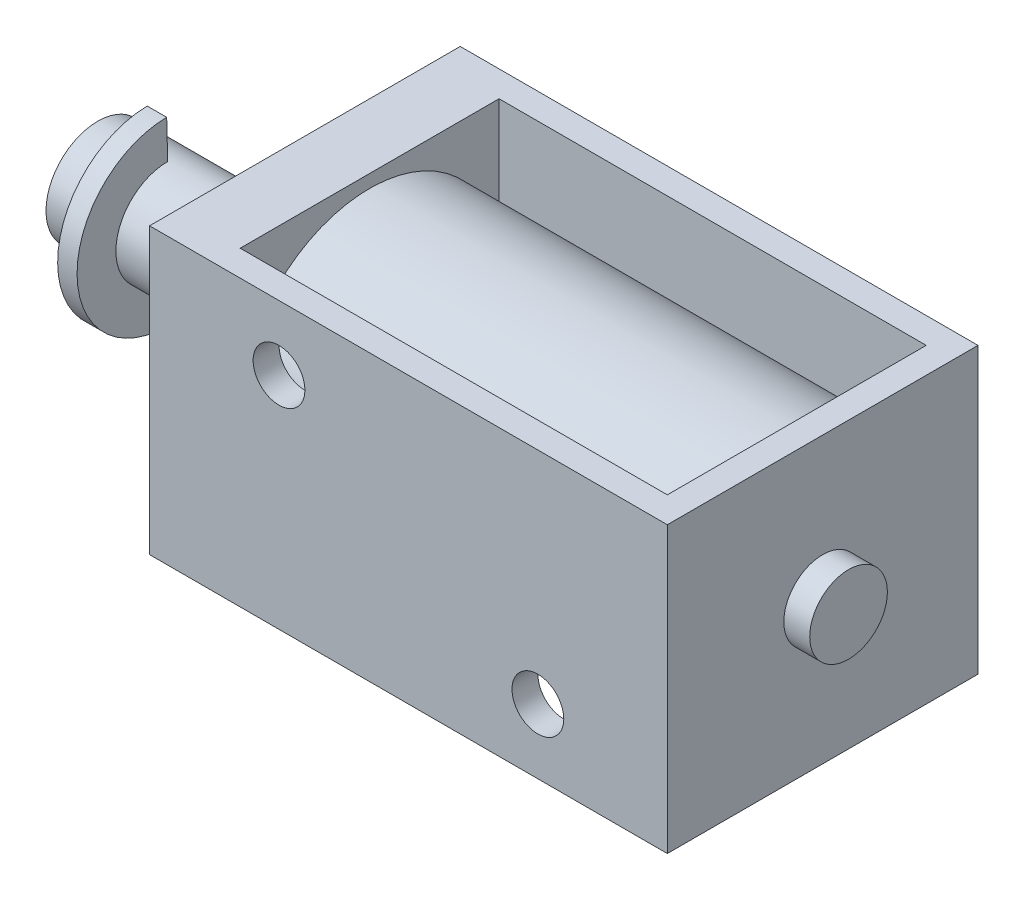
ISO-10303-21;
HEADER;
FILE_DESCRIPTION(('STEP AP214'),'2;1');
FILE_NAME('part.step','',(''),(''),'','','');
FILE_SCHEMA(('AUTOMOTIVE_DESIGN { 1 0 10303 214 1 1 1 1 }'));
ENDSEC;
DATA;
#1=APPLICATION_CONTEXT('core data for automotive mechanical design processes');
#2=APPLICATION_PROTOCOL_DEFINITION('international standard','automotive_design',2000,#1);
#3=PRODUCT_CONTEXT('',#1,'mechanical');
#4=PRODUCT('Part','Part','',(#3));
#5=PRODUCT_RELATED_PRODUCT_CATEGORY('part','',(#4));
#6=PRODUCT_DEFINITION_FORMATION('','',#4);
#7=PRODUCT_DEFINITION_CONTEXT('part definition',#1,'design');
#8=PRODUCT_DEFINITION('design','',#6,#7);
#9=PRODUCT_DEFINITION_SHAPE('','',#8);
#10=(LENGTH_UNIT() NAMED_UNIT(*) SI_UNIT(.MILLI.,.METRE.));
#11=(NAMED_UNIT(*) PLANE_ANGLE_UNIT() SI_UNIT($,.RADIAN.));
#12=(NAMED_UNIT(*) SI_UNIT($,.STERADIAN.) SOLID_ANGLE_UNIT());
#13=UNCERTAINTY_MEASURE_WITH_UNIT(LENGTH_MEASURE(1.E-05),#10,'distance_accuracy_value','');
#14=(GEOMETRIC_REPRESENTATION_CONTEXT(3) GLOBAL_UNCERTAINTY_ASSIGNED_CONTEXT((#13)) GLOBAL_UNIT_ASSIGNED_CONTEXT((#10,
#11,#12)) REPRESENTATION_CONTEXT('',''));
#15=CARTESIAN_POINT('',(0.,0.,0.));
#16=DIRECTION('',(0.,0.,1.));
#17=DIRECTION('',(1.,0.,0.));
#18=AXIS2_PLACEMENT_3D('',#15,#16,#17);
#19=CARTESIAN_POINT('',(19.,0.,-11.));
#20=DIRECTION('',(1.,0.,0.));
#21=DIRECTION('',(0.,0.,-1.));
#22=AXIS2_PLACEMENT_3D('',#19,#20,#21);
#23=PLANE('',#22);
#24=CARTESIAN_POINT('',(19.0000000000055,5.5,-6.));
#25=DIRECTION('',(1.,0.,0.));
#26=DIRECTION('',(0.,0.,-1.));
#27=AXIS2_PLACEMENT_3D('',#24,#25,#26);
#28=CIRCLE('',#27,5.);
#29=CARTESIAN_POINT('',(19.0000000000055,5.5,-11.));
#30=VERTEX_POINT('',#29);
#31=EDGE_CURVE('E78',#30,#30,#28,.T.);
#32=ORIENTED_EDGE('',*,*,#31,.T.);
#33=EDGE_LOOP('',(#32));
#34=FACE_BOUND('',#33,.T.);
#35=ADVANCED_FACE('F43',(#34),#23,.T.);
#36=CARTESIAN_POINT('',(2.5,5.5,-6.));
#37=DIRECTION('',(1.,0.,0.));
#38=DIRECTION('',(0.,0.,-1.));
#39=AXIS2_PLACEMENT_3D('',#36,#37,#38);
#40=PLANE('',#39);
#41=CARTESIAN_POINT('',(2.5,5.5,-6.));
#42=DIRECTION('',(1.,0.,0.));
#43=DIRECTION('',(0.,0.,-1.));
#44=AXIS2_PLACEMENT_3D('',#41,#42,#43);
#45=CIRCLE('',#44,5.);
#46=CARTESIAN_POINT('',(2.5,5.5,-11.));
#47=VERTEX_POINT('',#46);
#48=EDGE_CURVE('E108',#47,#47,#45,.T.);
#49=ORIENTED_EDGE('',*,*,#48,.F.);
#50=EDGE_LOOP('',(#49));
#51=FACE_BOUND('',#50,.T.);
#52=ADVANCED_FACE('F96',(#51),#40,.F.);
#53=CARTESIAN_POINT('',(500000.,5.5,-6.00000000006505));
#54=DIRECTION('',(-1.,0.,0.));
#55=DIRECTION('',(0.,0.,1.));
#56=AXIS2_PLACEMENT_3D('',#53,#54,#55);
#57=CYLINDRICAL_SURFACE('',#56,5.);
#58=DIRECTION('',(-1.,0.,0.));
#59=VECTOR('',#58,1.);
#60=CARTESIAN_POINT('',(500000.,2.50000000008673,-2.));
#61=LINE('',#60,#59);
#62=CARTESIAN_POINT('',(14.00000000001,2.50000000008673,-1.99999999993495));
#63=VERTEX_POINT('',#62);
#64=CARTESIAN_POINT('',(16.,2.50000000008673,-2.));
#65=VERTEX_POINT('',#64);
#66=EDGE_CURVE('E54',#63,#65,#61,.F.);
#67=ORIENTED_EDGE('',*,*,#66,.F.);
#68=CARTESIAN_POINT('',(14.,2.50000000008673,-2.));
#69=CARTESIAN_POINT('',(13.9999996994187,2.53399458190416,-1.97449612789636));
#70=CARTESIAN_POINT('',(14.0017343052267,2.56833744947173,-1.94942402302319));
#71=CARTESIAN_POINT('',(14.0088815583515,2.63745557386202,-1.90028975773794));
#72=CARTESIAN_POINT('',(14.0143011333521,2.67223152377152,-1.87622959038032));
#73=CARTESIAN_POINT('',(14.0290598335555,2.74197097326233,-1.82926220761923));
#74=CARTESIAN_POINT('',(14.0384157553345,2.77693463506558,-1.80636040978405));
#75=CARTESIAN_POINT('',(14.0612095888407,2.84642414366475,-1.76204844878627));
#76=CARTESIAN_POINT('',(14.0746437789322,2.88095035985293,-1.74063694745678));
#77=CARTESIAN_POINT('',(14.1124068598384,2.96372057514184,-1.69064871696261));
#78=CARTESIAN_POINT('',(14.1389376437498,3.01150826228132,-1.66292953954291));
#79=CARTESIAN_POINT('',(14.2006215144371,3.10336223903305,-1.6115040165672));
#80=CARTESIAN_POINT('',(14.2357519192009,3.14743791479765,-1.58778738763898));
#81=CARTESIAN_POINT('',(14.3145006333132,3.23032564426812,-1.54457874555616));
#82=CARTESIAN_POINT('',(14.3581685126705,3.2691045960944,-1.52511288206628));
#83=CARTESIAN_POINT('',(14.4528625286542,3.33910957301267,-1.49088927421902));
#84=CARTESIAN_POINT('',(14.5038907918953,3.37033340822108,-1.47613289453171));
#85=CARTESIAN_POINT('',(14.6065050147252,3.42093331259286,-1.45267252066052));
#86=CARTESIAN_POINT('',(14.6575739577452,3.44115513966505,-1.44352561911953));
#87=CARTESIAN_POINT('',(14.762842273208,3.47302422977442,-1.42925849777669));
#88=CARTESIAN_POINT('',(14.817039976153,3.48467602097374,-1.42413615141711));
#89=CARTESIAN_POINT('',(14.9237530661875,3.49845813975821,-1.41809178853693));
#90=CARTESIAN_POINT('',(14.9761925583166,3.50108539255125,-1.41695050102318));
#91=CARTESIAN_POINT('',(15.0807891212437,3.4981027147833,-1.41825249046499));
#92=CARTESIAN_POINT('',(15.1329462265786,3.49249381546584,-1.42069531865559));
#93=CARTESIAN_POINT('',(15.2347293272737,3.47341951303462,-1.4291055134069));
#94=CARTESIAN_POINT('',(15.2843807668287,3.46006695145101,-1.43502227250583));
#95=CARTESIAN_POINT('',(15.3805809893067,3.42615304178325,-1.4503294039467));
#96=CARTESIAN_POINT('',(15.4271297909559,3.40559173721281,-1.45971975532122));
#97=CARTESIAN_POINT('',(15.5166789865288,3.35770791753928,-1.48211430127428));
#98=CARTESIAN_POINT('',(15.5596088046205,3.3302802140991,-1.49517514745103));
#99=CARTESIAN_POINT('',(15.6400854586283,3.26994904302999,-1.52473479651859));
#100=CARTESIAN_POINT('',(15.6776314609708,3.23704472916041,-1.5412341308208));
#101=CARTESIAN_POINT('',(15.7484979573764,3.16515408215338,-1.57843771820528));
#102=CARTESIAN_POINT('',(15.7814940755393,3.12593944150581,-1.59931696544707));
#103=CARTESIAN_POINT('',(15.8404311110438,3.04425656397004,-1.64437140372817));
#104=CARTESIAN_POINT('',(15.866369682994,3.00178725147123,-1.66854768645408));
#105=CARTESIAN_POINT('',(15.9134301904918,2.91053780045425,-1.7224111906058));
#106=CARTESIAN_POINT('',(15.9337982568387,2.8615541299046,-1.75240856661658));
#107=CARTESIAN_POINT('',(15.9662602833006,2.76276754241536,-1.8153863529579));
#108=CARTESIAN_POINT('',(15.9783504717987,2.71296426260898,-1.8483681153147));
#109=CARTESIAN_POINT('',(15.9911173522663,2.63588448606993,-1.90146823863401));
#110=CARTESIAN_POINT('',(15.9944791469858,2.6084544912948,-1.92077307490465));
#111=CARTESIAN_POINT('',(15.998916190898,2.55394946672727,-1.95996141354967));
#112=CARTESIAN_POINT('',(15.999998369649,2.52687361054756,-1.97984297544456));
#113=CARTESIAN_POINT('',(16.,2.5,-2.));
#114=B_SPLINE_CURVE_WITH_KNOTS('',3,(#68,#69,#70,#71,#72,#73,#74,#75,#76,#77,#78,#79,#80,#81,
#82,#83,#84,#85,#86,#87,#88,#89,#90,#91,#92,#93,#94,#95,#96,#97,#98,#99,#100,#101,#102,#103,
#104,#105,#106,#107,#108,#109,#110,#111,#112,#113),.UNSPECIFIED.,.F.,.F.,(4,2,2,2,2,2,2,2,2,2,2,
2,2,2,2,2,2,2,2,2,2,2,4),(0.,0.127483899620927,0.255208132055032,0.383482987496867,
0.511641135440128,0.694674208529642,0.877229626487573,1.06087827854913,1.24458009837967,
1.4107675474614,1.57686712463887,1.73365980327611,1.89043285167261,2.04497682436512,
2.19951986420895,2.35659321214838,2.51369085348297,2.67901784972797,2.84439972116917,
3.02653100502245,3.20874521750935,3.30980206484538,3.41055127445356),.UNSPECIFIED.);
#115=EDGE_CURVE('E12',#63,#65,#114,.T.);
#116=ORIENTED_EDGE('',*,*,#115,.T.);
#117=EDGE_LOOP('',(#67,#116));
#118=FACE_BOUND('',#117,.T.);
#119=DIRECTION('',(-1.,0.,0.));
#120=VECTOR('',#119,1.);
#121=CARTESIAN_POINT('',(500000.,8.49999999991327,-2.));
#122=LINE('',#121,#120);
#123=CARTESIAN_POINT('',(6.00000000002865,8.49999999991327,-1.99999999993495));
#124=VERTEX_POINT('',#123);
#125=CARTESIAN_POINT('',(4.,8.49999999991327,-2.));
#126=VERTEX_POINT('',#125);
#127=EDGE_CURVE('E73',#124,#126,#122,.T.);
#128=ORIENTED_EDGE('',*,*,#127,.F.);
#129=CARTESIAN_POINT('',(6.,8.5,-2.));
#130=CARTESIAN_POINT('',(6.00000030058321,8.46600541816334,-1.97449612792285));
#131=CARTESIAN_POINT('',(5.99826569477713,8.43166255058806,-1.94942402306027));
#132=CARTESIAN_POINT('',(5.99111844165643,8.36254442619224,-1.90028975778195));
#133=CARTESIAN_POINT('',(5.98569886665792,8.32776847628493,-1.87622959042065));
#134=CARTESIAN_POINT('',(5.97094016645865,8.2580290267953,-1.82926220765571));
#135=CARTESIAN_POINT('',(5.96158424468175,8.22306536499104,-1.80636040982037));
#136=CARTESIAN_POINT('',(5.93879041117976,8.15357585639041,-1.76204844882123));
#137=CARTESIAN_POINT('',(5.92535622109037,8.11904964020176,-1.74063694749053));
#138=CARTESIAN_POINT('',(5.88759314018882,8.03627942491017,-1.690648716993));
#139=CARTESIAN_POINT('',(5.8610623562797,7.9884917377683,-1.66292953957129));
#140=CARTESIAN_POINT('',(5.79937848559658,7.89663776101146,-1.61150401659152));
#141=CARTESIAN_POINT('',(5.76424808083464,7.85256208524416,-1.58778738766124));
#142=CARTESIAN_POINT('',(5.68549936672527,7.76967435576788,-1.54457874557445));
#143=CARTESIAN_POINT('',(5.641831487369,7.73089540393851,-1.52511288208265));
#144=CARTESIAN_POINT('',(5.54713747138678,7.66089042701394,-1.49088927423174));
#145=CARTESIAN_POINT('',(5.4961092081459,7.62966659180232,-1.4761328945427));
#146=CARTESIAN_POINT('',(5.39349498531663,7.57906668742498,-1.45267252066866));
#147=CARTESIAN_POINT('',(5.34242604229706,7.55884486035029,-1.44352561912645));
#148=CARTESIAN_POINT('',(5.23715772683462,7.52697577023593,-1.42925849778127));
#149=CARTESIAN_POINT('',(5.18296002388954,7.51532397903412,-1.42413615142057));
#150=CARTESIAN_POINT('',(5.07624693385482,7.50154186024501,-1.41809178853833));
#151=CARTESIAN_POINT('',(5.02380744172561,7.49891460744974,-1.41695050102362));
#152=CARTESIAN_POINT('',(4.91921087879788,7.50189728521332,-1.41825249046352));
#153=CARTESIAN_POINT('',(4.86705377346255,7.50750618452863,-1.42069531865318));
#154=CARTESIAN_POINT('',(4.76527067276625,7.52658048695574,-1.42910551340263));
#155=CARTESIAN_POINT('',(4.71561923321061,7.53993304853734,-1.43502227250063));
#156=CARTESIAN_POINT('',(4.619419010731,7.57384695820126,-1.45032940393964));
#157=CARTESIAN_POINT('',(4.57287020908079,7.59440826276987,-1.45971975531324));
#158=CARTESIAN_POINT('',(4.48332101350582,7.64229208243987,-1.48211430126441));
#159=CARTESIAN_POINT('',(4.44039119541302,7.66971978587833,-1.49517514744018));
#160=CARTESIAN_POINT('',(4.35991454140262,7.73005095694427,-1.52473479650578));
#161=CARTESIAN_POINT('',(4.32236853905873,7.7629552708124,-1.54123413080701));
#162=CARTESIAN_POINT('',(4.25150204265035,7.83484591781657,-1.57843771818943));
#163=CARTESIAN_POINT('',(4.21850592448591,7.87406055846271,-1.5993169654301));
#164=CARTESIAN_POINT('',(4.1595688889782,7.95574343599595,-1.64437140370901));
#165=CARTESIAN_POINT('',(4.1336303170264,7.99821274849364,-1.66854768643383));
#166=CARTESIAN_POINT('',(4.0865698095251,8.08946219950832,-1.72241119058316));
#167=CARTESIAN_POINT('',(4.06620174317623,8.13844587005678,-1.75240856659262));
#168=CARTESIAN_POINT('',(4.03373971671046,8.23723245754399,-1.81538635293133));
#169=CARTESIAN_POINT('',(4.02164952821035,8.28703573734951,-1.84836811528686));
#170=CARTESIAN_POINT('',(4.00888264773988,8.36411551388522,-1.9014682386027));
#171=CARTESIAN_POINT('',(4.00552085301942,8.39154550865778,-1.92077307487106));
#172=CARTESIAN_POINT('',(4.00108380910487,8.44605053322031,-1.95996141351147));
#173=CARTESIAN_POINT('',(4.00000163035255,8.47312638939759,-1.97984297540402));
#174=CARTESIAN_POINT('',(3.99999999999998,8.49999999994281,-1.99999999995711));
#175=B_SPLINE_CURVE_WITH_KNOTS('',3,(#129,#130,#131,#132,#133,#134,#135,#136,#137,#138,#139,
#140,#141,#142,#143,#144,#145,#146,#147,#148,#149,#150,#151,#152,#153,#154,#155,#156,#157,#158,
#159,#160,#161,#162,#163,#164,#165,#166,#167,#168,#169,#170,#171,#172,#173,#174),.UNSPECIFIED.,
.F.,.F.,(4,2,2,2,2,2,2,2,2,2,2,2,2,2,2,2,2,2,2,2,2,2,4),(0.,0.12748389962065,0.255208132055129,
0.383482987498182,0.511641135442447,0.694674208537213,0.877229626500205,1.06087827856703,
1.24458009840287,1.4107675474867,1.57686712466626,1.73365980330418,1.89043285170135,
2.04497682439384,2.19951986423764,2.35659321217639,2.51369085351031,2.67901784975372,
2.84439972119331,3.02653100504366,3.2087452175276,3.30980206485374,3.41055127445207),.UNSPECIFIED.);
#176=EDGE_CURVE('E77',#124,#126,#175,.T.);
#177=ORIENTED_EDGE('',*,*,#176,.T.);
#178=EDGE_LOOP('',(#128,#177));
#179=FACE_BOUND('',#178,.T.);
#180=ORIENTED_EDGE('',*,*,#48,.T.);
#181=EDGE_LOOP('',(#180));
#182=FACE_BOUND('',#181,.T.);
#183=ORIENTED_EDGE('',*,*,#31,.F.);
#184=EDGE_LOOP('',(#183));
#185=FACE_BOUND('',#184,.T.);
#186=ADVANCED_FACE('F83',(#118,#179,#182,#185),#57,.T.);
#187=CARTESIAN_POINT('',(5.,8.5,-2.));
#188=DIRECTION('',(0.,0.,1.));
#189=DIRECTION('',(1.,0.,0.));
#190=AXIS2_PLACEMENT_3D('',#187,#188,#189);
#191=CYLINDRICAL_SURFACE('',#190,1.);
#192=CARTESIAN_POINT('',(5.,8.5,-2.));
#193=DIRECTION('',(0.,0.,1.));
#194=DIRECTION('',(1.,0.,0.));
#195=AXIS2_PLACEMENT_3D('',#192,#193,#194);
#196=CIRCLE('',#195,1.);
#197=EDGE_CURVE('E67',#126,#124,#196,.T.);
#198=ORIENTED_EDGE('',*,*,#197,.F.);
#199=ORIENTED_EDGE('',*,*,#176,.F.);
#200=EDGE_LOOP('',(#198,#199));
#201=FACE_BOUND('',#200,.T.);
#202=ADVANCED_FACE('F81',(#201),#191,.F.);
#203=CARTESIAN_POINT('',(5.,8.5,-2.));
#204=DIRECTION('',(0.,0.,1.));
#205=DIRECTION('',(1.,0.,0.));
#206=AXIS2_PLACEMENT_3D('',#203,#204,#205);
#207=PLANE('',#206);
#208=ORIENTED_EDGE('',*,*,#127,.T.);
#209=ORIENTED_EDGE('',*,*,#197,.T.);
#210=EDGE_LOOP('',(#208,#209));
#211=FACE_BOUND('',#210,.T.);
#212=ADVANCED_FACE('F74',(#211),#207,.T.);
#213=CARTESIAN_POINT('',(15.,2.5,-2.));
#214=DIRECTION('',(0.,0.,1.));
#215=DIRECTION('',(1.,0.,0.));
#216=AXIS2_PLACEMENT_3D('',#213,#214,#215);
#217=CYLINDRICAL_SURFACE('',#216,1.);
#218=CARTESIAN_POINT('',(15.,2.5,-2.));
#219=DIRECTION('',(0.,0.,1.));
#220=DIRECTION('',(1.,0.,0.));
#221=AXIS2_PLACEMENT_3D('',#218,#219,#220);
#222=CIRCLE('',#221,1.);
#223=EDGE_CURVE('E60',#65,#63,#222,.T.);
#224=ORIENTED_EDGE('',*,*,#223,.F.);
#225=ORIENTED_EDGE('',*,*,#115,.F.);
#226=EDGE_LOOP('',(#224,#225));
#227=FACE_BOUND('',#226,.T.);
#228=ADVANCED_FACE('F138',(#227),#217,.F.);
#229=CARTESIAN_POINT('',(15.,2.5,-2.));
#230=DIRECTION('',(0.,0.,1.));
#231=DIRECTION('',(1.,0.,0.));
#232=AXIS2_PLACEMENT_3D('',#229,#230,#231);
#233=PLANE('',#232);
#234=ORIENTED_EDGE('',*,*,#66,.T.);
#235=ORIENTED_EDGE('',*,*,#223,.T.);
#236=EDGE_LOOP('',(#234,#235));
#237=FACE_BOUND('',#236,.T.);
#238=ADVANCED_FACE('F146',(#237),#233,.T.);
#239=CLOSED_SHELL('',(#35,#52,#186,#202,#212,#228,#238));
#240=MANIFOLD_SOLID_BREP('B2',#239);
#241=CARTESIAN_POINT('',(20.,11.,0.));
#242=DIRECTION('',(-1.,0.,0.));
#243=DIRECTION('',(0.,0.,1.));
#244=AXIS2_PLACEMENT_3D('',#241,#242,#243);
#245=PLANE('',#244);
#246=DIRECTION('',(0.,0.,-1.));
#247=VECTOR('',#246,1.);
#248=CARTESIAN_POINT('',(20.,0.,0.));
#249=LINE('',#248,#247);
#250=CARTESIAN_POINT('',(20.,0.,0.));
#251=VERTEX_POINT('',#250);
#252=CARTESIAN_POINT('',(20.,0.,-12.));
#253=VERTEX_POINT('',#252);
#254=EDGE_CURVE('E345',#251,#253,#249,.T.);
#255=ORIENTED_EDGE('',*,*,#254,.T.);
#256=DIRECTION('',(0.,-1.,0.));
#257=VECTOR('',#256,1.);
#258=CARTESIAN_POINT('',(20.,11.,-12.));
#259=LINE('',#258,#257);
#260=CARTESIAN_POINT('',(20.,11.,-12.));
#261=VERTEX_POINT('',#260);
#262=EDGE_CURVE('E350',#261,#253,#259,.T.);
#263=ORIENTED_EDGE('',*,*,#262,.F.);
#264=DIRECTION('',(0.,0.,-1.));
#265=VECTOR('',#264,1.);
#266=CARTESIAN_POINT('',(20.,11.,0.));
#267=LINE('',#266,#265);
#268=CARTESIAN_POINT('',(20.,11.,0.));
#269=VERTEX_POINT('',#268);
#270=EDGE_CURVE('E336',#269,#261,#267,.T.);
#271=ORIENTED_EDGE('',*,*,#270,.F.);
#272=DIRECTION('',(0.,-1.,0.));
#273=VECTOR('',#272,1.);
#274=CARTESIAN_POINT('',(20.,11.,0.));
#275=LINE('',#274,#273);
#276=EDGE_CURVE('E353',#269,#251,#275,.T.);
#277=ORIENTED_EDGE('',*,*,#276,.T.);
#278=EDGE_LOOP('',(#255,#263,#271,#277));
#279=FACE_BOUND('',#278,.T.);
#280=CARTESIAN_POINT('',(20.,5.5,-6.));
#281=DIRECTION('',(-1.,0.,0.));
#282=DIRECTION('',(0.,0.,1.));
#283=AXIS2_PLACEMENT_3D('',#280,#281,#282);
#284=CIRCLE('',#283,1.5);
#285=CARTESIAN_POINT('',(20.,5.5,-4.5));
#286=VERTEX_POINT('',#285);
#287=EDGE_CURVE('E41',#286,#286,#284,.F.);
#288=ORIENTED_EDGE('',*,*,#287,.F.);
#289=EDGE_LOOP('',(#288));
#290=FACE_BOUND('',#289,.T.);
#291=ADVANCED_FACE('F166',(#279,#290),#245,.F.);
#292=CARTESIAN_POINT('',(0.,11.,0.));
#293=DIRECTION('',(1.,0.,0.));
#294=DIRECTION('',(0.,0.,-1.));
#295=AXIS2_PLACEMENT_3D('',#292,#293,#294);
#296=PLANE('',#295);
#297=DIRECTION('',(0.,0.,1.));
#298=VECTOR('',#297,1.);
#299=CARTESIAN_POINT('',(0.,0.,0.));
#300=LINE('',#299,#298);
#301=CARTESIAN_POINT('',(0.,0.,-12.));
#302=VERTEX_POINT('',#301);
#303=CARTESIAN_POINT('',(0.,0.,0.));
#304=VERTEX_POINT('',#303);
#305=EDGE_CURVE('E323',#302,#304,#300,.T.);
#306=ORIENTED_EDGE('',*,*,#305,.T.);
#307=DIRECTION('',(0.,-1.,0.));
#308=VECTOR('',#307,1.);
#309=CARTESIAN_POINT('',(0.,11.,0.));
#310=LINE('',#309,#308);
#311=CARTESIAN_POINT('',(0.,11.,0.));
#312=VERTEX_POINT('',#311);
#313=EDGE_CURVE('E356',#312,#304,#310,.T.);
#314=ORIENTED_EDGE('',*,*,#313,.F.);
#315=DIRECTION('',(0.,0.,1.));
#316=VECTOR('',#315,1.);
#317=CARTESIAN_POINT('',(0.,11.,0.));
#318=LINE('',#317,#316);
#319=CARTESIAN_POINT('',(0.,11.,-12.));
#320=VERTEX_POINT('',#319);
#321=EDGE_CURVE('E330',#320,#312,#318,.T.);
#322=ORIENTED_EDGE('',*,*,#321,.F.);
#323=DIRECTION('',(0.,-1.,0.));
#324=VECTOR('',#323,1.);
#325=CARTESIAN_POINT('',(0.,11.,-12.));
#326=LINE('',#325,#324);
#327=EDGE_CURVE('E340',#320,#302,#326,.T.);
#328=ORIENTED_EDGE('',*,*,#327,.T.);
#329=EDGE_LOOP('',(#306,#314,#322,#328));
#330=FACE_BOUND('',#329,.T.);
#331=CARTESIAN_POINT('',(0.,5.5,-6.));
#332=DIRECTION('',(1.,0.,0.));
#333=DIRECTION('',(0.,0.,-1.));
#334=AXIS2_PLACEMENT_3D('',#331,#332,#333);
#335=CIRCLE('',#334,2.);
#336=CARTESIAN_POINT('',(0.,5.5,-8.));
#337=VERTEX_POINT('',#336);
#338=EDGE_CURVE('E175',#337,#337,#335,.F.);
#339=ORIENTED_EDGE('',*,*,#338,.F.);
#340=EDGE_LOOP('',(#339));
#341=FACE_BOUND('',#340,.T.);
#342=ADVANCED_FACE('F168',(#330,#341),#296,.F.);
#343=CARTESIAN_POINT('',(0.,11.,0.));
#344=DIRECTION('',(0.,0.,-1.));
#345=DIRECTION('',(-1.,0.,0.));
#346=AXIS2_PLACEMENT_3D('',#343,#344,#345);
#347=PLANE('',#346);
#348=CARTESIAN_POINT('',(15.,2.5,0.));
#349=DIRECTION('',(0.,0.,1.));
#350=DIRECTION('',(1.,0.,0.));
#351=AXIS2_PLACEMENT_3D('',#348,#349,#350);
#352=CIRCLE('',#351,1.);
#353=CARTESIAN_POINT('',(16.,2.5,0.));
#354=VERTEX_POINT('',#353);
#355=EDGE_CURVE('E362',#354,#354,#352,.T.);
#356=ORIENTED_EDGE('',*,*,#355,.F.);
#357=EDGE_LOOP('',(#356));
#358=FACE_BOUND('',#357,.T.);
#359=CARTESIAN_POINT('',(5.,8.5,0.));
#360=DIRECTION('',(0.,0.,1.));
#361=DIRECTION('',(1.,0.,0.));
#362=AXIS2_PLACEMENT_3D('',#359,#360,#361);
#363=CIRCLE('',#362,1.);
#364=CARTESIAN_POINT('',(6.,8.5,0.));
#365=VERTEX_POINT('',#364);
#366=EDGE_CURVE('E367',#365,#365,#363,.T.);
#367=ORIENTED_EDGE('',*,*,#366,.F.);
#368=EDGE_LOOP('',(#367));
#369=FACE_BOUND('',#368,.T.);
#370=DIRECTION('',(1.,0.,0.));
#371=VECTOR('',#370,1.);
#372=CARTESIAN_POINT('',(0.,0.,0.));
#373=LINE('',#372,#371);
#374=EDGE_CURVE('E343',#304,#251,#373,.T.);
#375=ORIENTED_EDGE('',*,*,#374,.T.);
#376=ORIENTED_EDGE('',*,*,#276,.F.);
#377=DIRECTION('',(1.,0.,0.));
#378=VECTOR('',#377,1.);
#379=CARTESIAN_POINT('',(0.,11.,0.));
#380=LINE('',#379,#378);
#381=EDGE_CURVE('E333',#312,#269,#380,.T.);
#382=ORIENTED_EDGE('',*,*,#381,.F.);
#383=ORIENTED_EDGE('',*,*,#313,.T.);
#384=EDGE_LOOP('',(#375,#376,#382,#383));
#385=FACE_BOUND('',#384,.T.);
#386=ADVANCED_FACE('F378',(#358,#369,#385),#347,.F.);
#387=CARTESIAN_POINT('',(0.,11.,-12.));
#388=DIRECTION('',(0.,0.,1.));
#389=DIRECTION('',(1.,0.,0.));
#390=AXIS2_PLACEMENT_3D('',#387,#388,#389);
#391=PLANE('',#390);
#392=DIRECTION('',(-1.,0.,0.));
#393=VECTOR('',#392,1.);
#394=CARTESIAN_POINT('',(0.,0.,-12.));
#395=LINE('',#394,#393);
#396=EDGE_CURVE('E334',#253,#302,#395,.T.);
#397=ORIENTED_EDGE('',*,*,#396,.T.);
#398=ORIENTED_EDGE('',*,*,#327,.F.);
#399=DIRECTION('',(-1.,0.,0.));
#400=VECTOR('',#399,1.);
#401=CARTESIAN_POINT('',(0.,11.,-12.));
#402=LINE('',#401,#400);
#403=EDGE_CURVE('E338',#261,#320,#402,.T.);
#404=ORIENTED_EDGE('',*,*,#403,.F.);
#405=ORIENTED_EDGE('',*,*,#262,.T.);
#406=EDGE_LOOP('',(#397,#398,#404,#405));
#407=FACE_BOUND('',#406,.T.);
#408=ADVANCED_FACE('F381',(#407),#391,.F.);
#409=CARTESIAN_POINT('',(0.,11.,0.));
#410=DIRECTION('',(0.,-1.,0.));
#411=DIRECTION('',(0.,0.,-1.));
#412=AXIS2_PLACEMENT_3D('',#409,#410,#411);
#413=PLANE('',#412);
#414=DIRECTION('',(1.,0.,0.));
#415=VECTOR('',#414,1.);
#416=CARTESIAN_POINT('',(2.5,11.,-1.));
#417=LINE('',#416,#415);
#418=CARTESIAN_POINT('',(2.5,11.,-1.));
#419=VERTEX_POINT('',#418);
#420=CARTESIAN_POINT('',(19.,11.,-1.));
#421=VERTEX_POINT('',#420);
#422=EDGE_CURVE('E313',#419,#421,#417,.T.);
#423=ORIENTED_EDGE('',*,*,#422,.F.);
#424=DIRECTION('',(0.,0.,1.));
#425=VECTOR('',#424,1.);
#426=CARTESIAN_POINT('',(2.5,11.,-11.));
#427=LINE('',#426,#425);
#428=CARTESIAN_POINT('',(2.5,11.,-11.));
#429=VERTEX_POINT('',#428);
#430=EDGE_CURVE('E297',#429,#419,#427,.T.);
#431=ORIENTED_EDGE('',*,*,#430,.F.);
#432=DIRECTION('',(-1.,0.,0.));
#433=VECTOR('',#432,1.);
#434=CARTESIAN_POINT('',(2.5,11.,-11.));
#435=LINE('',#434,#433);
#436=CARTESIAN_POINT('',(19.,11.,-11.));
#437=VERTEX_POINT('',#436);
#438=EDGE_CURVE('E302',#437,#429,#435,.T.);
#439=ORIENTED_EDGE('',*,*,#438,.F.);
#440=DIRECTION('',(0.,0.,-1.));
#441=VECTOR('',#440,1.);
#442=CARTESIAN_POINT('',(19.,11.,-11.));
#443=LINE('',#442,#441);
#444=EDGE_CURVE('E316',#421,#437,#443,.T.);
#445=ORIENTED_EDGE('',*,*,#444,.F.);
#446=EDGE_LOOP('',(#423,#431,#439,#445));
#447=FACE_BOUND('',#446,.T.);
#448=ORIENTED_EDGE('',*,*,#321,.T.);
#449=ORIENTED_EDGE('',*,*,#381,.T.);
#450=ORIENTED_EDGE('',*,*,#270,.T.);
#451=ORIENTED_EDGE('',*,*,#403,.T.);
#452=EDGE_LOOP('',(#448,#449,#450,#451));
#453=FACE_BOUND('',#452,.T.);
#454=ADVANCED_FACE('F401',(#447,#453),#413,.F.);
#455=CARTESIAN_POINT('',(0.,0.,0.));
#456=DIRECTION('',(0.,-1.,0.));
#457=DIRECTION('',(0.,0.,-1.));
#458=AXIS2_PLACEMENT_3D('',#455,#456,#457);
#459=PLANE('',#458);
#460=DIRECTION('',(0.,0.,1.));
#461=VECTOR('',#460,1.);
#462=CARTESIAN_POINT('',(2.5,0.,-11.));
#463=LINE('',#462,#461);
#464=CARTESIAN_POINT('',(2.5,0.,-11.));
#465=VERTEX_POINT('',#464);
#466=CARTESIAN_POINT('',(2.5,0.,-1.));
#467=VERTEX_POINT('',#466);
#468=EDGE_CURVE('E298',#465,#467,#463,.T.);
#469=ORIENTED_EDGE('',*,*,#468,.T.);
#470=DIRECTION('',(1.,0.,0.));
#471=VECTOR('',#470,1.);
#472=CARTESIAN_POINT('',(2.5,0.,-1.));
#473=LINE('',#472,#471);
#474=CARTESIAN_POINT('',(19.,0.,-1.));
#475=VERTEX_POINT('',#474);
#476=EDGE_CURVE('E301',#467,#475,#473,.T.);
#477=ORIENTED_EDGE('',*,*,#476,.T.);
#478=DIRECTION('',(0.,0.,-1.));
#479=VECTOR('',#478,1.);
#480=CARTESIAN_POINT('',(19.,0.,-11.));
#481=LINE('',#480,#479);
#482=CARTESIAN_POINT('',(19.,0.,-11.));
#483=VERTEX_POINT('',#482);
#484=EDGE_CURVE('E305',#475,#483,#481,.T.);
#485=ORIENTED_EDGE('',*,*,#484,.T.);
#486=DIRECTION('',(-1.,0.,0.));
#487=VECTOR('',#486,1.);
#488=CARTESIAN_POINT('',(2.5,0.,-11.));
#489=LINE('',#488,#487);
#490=EDGE_CURVE('E308',#483,#465,#489,.T.);
#491=ORIENTED_EDGE('',*,*,#490,.T.);
#492=EDGE_LOOP('',(#469,#477,#485,#491));
#493=FACE_BOUND('',#492,.T.);
#494=ORIENTED_EDGE('',*,*,#305,.F.);
#495=ORIENTED_EDGE('',*,*,#396,.F.);
#496=ORIENTED_EDGE('',*,*,#254,.F.);
#497=ORIENTED_EDGE('',*,*,#374,.F.);
#498=EDGE_LOOP('',(#494,#495,#496,#497));
#499=FACE_BOUND('',#498,.T.);
#500=ADVANCED_FACE('F393',(#493,#499),#459,.T.);
#501=CARTESIAN_POINT('',(2.5,0.,-11.));
#502=DIRECTION('',(-1.,0.,0.));
#503=DIRECTION('',(0.,0.,1.));
#504=AXIS2_PLACEMENT_3D('',#501,#502,#503);
#505=PLANE('',#504);
#506=ORIENTED_EDGE('',*,*,#430,.T.);
#507=DIRECTION('',(0.,1.,0.));
#508=VECTOR('',#507,1.);
#509=CARTESIAN_POINT('',(2.5,0.,-1.));
#510=LINE('',#509,#508);
#511=EDGE_CURVE('E311',#467,#419,#510,.T.);
#512=ORIENTED_EDGE('',*,*,#511,.F.);
#513=ORIENTED_EDGE('',*,*,#468,.F.);
#514=DIRECTION('',(0.,1.,0.));
#515=VECTOR('',#514,1.);
#516=CARTESIAN_POINT('',(2.5,0.,-11.));
#517=LINE('',#516,#515);
#518=EDGE_CURVE('E321',#465,#429,#517,.T.);
#519=ORIENTED_EDGE('',*,*,#518,.T.);
#520=EDGE_LOOP('',(#506,#512,#513,#519));
#521=FACE_BOUND('',#520,.T.);
#522=ADVANCED_FACE('F409',(#521),#505,.F.);
#523=CARTESIAN_POINT('',(2.5,0.,-11.));
#524=DIRECTION('',(0.,0.,-1.));
#525=DIRECTION('',(-1.,0.,0.));
#526=AXIS2_PLACEMENT_3D('',#523,#524,#525);
#527=PLANE('',#526);
#528=ORIENTED_EDGE('',*,*,#438,.T.);
#529=ORIENTED_EDGE('',*,*,#518,.F.);
#530=ORIENTED_EDGE('',*,*,#490,.F.);
#531=DIRECTION('',(0.,1.,0.));
#532=VECTOR('',#531,1.);
#533=CARTESIAN_POINT('',(19.,0.,-11.));
#534=LINE('',#533,#532);
#535=EDGE_CURVE('E324',#483,#437,#534,.T.);
#536=ORIENTED_EDGE('',*,*,#535,.T.);
#537=EDGE_LOOP('',(#528,#529,#530,#536));
#538=FACE_BOUND('',#537,.T.);
#539=ADVANCED_FACE('F455',(#538),#527,.F.);
#540=CARTESIAN_POINT('',(19.,0.,-11.));
#541=DIRECTION('',(1.,0.,0.));
#542=DIRECTION('',(0.,0.,-1.));
#543=AXIS2_PLACEMENT_3D('',#540,#541,#542);
#544=PLANE('',#543);
#545=ORIENTED_EDGE('',*,*,#444,.T.);
#546=ORIENTED_EDGE('',*,*,#535,.F.);
#547=ORIENTED_EDGE('',*,*,#484,.F.);
#548=DIRECTION('',(0.,1.,0.));
#549=VECTOR('',#548,1.);
#550=CARTESIAN_POINT('',(19.,0.,-1.));
#551=LINE('',#550,#549);
#552=EDGE_CURVE('E326',#475,#421,#551,.T.);
#553=ORIENTED_EDGE('',*,*,#552,.T.);
#554=EDGE_LOOP('',(#545,#546,#547,#553));
#555=FACE_BOUND('',#554,.T.);
#556=ADVANCED_FACE('F463',(#555),#544,.F.);
#557=CARTESIAN_POINT('',(2.5,0.,-1.));
#558=DIRECTION('',(0.,0.,1.));
#559=DIRECTION('',(1.,0.,0.));
#560=AXIS2_PLACEMENT_3D('',#557,#558,#559);
#561=PLANE('',#560);
#562=CARTESIAN_POINT('',(15.,2.5,-1.));
#563=DIRECTION('',(0.,0.,1.));
#564=DIRECTION('',(1.,0.,0.));
#565=AXIS2_PLACEMENT_3D('',#562,#563,#564);
#566=CIRCLE('',#565,1.);
#567=CARTESIAN_POINT('',(16.,2.5,-1.));
#568=VERTEX_POINT('',#567);
#569=EDGE_CURVE('E170',#568,#568,#566,.T.);
#570=ORIENTED_EDGE('',*,*,#569,.T.);
#571=EDGE_LOOP('',(#570));
#572=FACE_BOUND('',#571,.T.);
#573=CARTESIAN_POINT('',(5.,8.5,-1.));
#574=DIRECTION('',(0.,0.,1.));
#575=DIRECTION('',(1.,0.,0.));
#576=AXIS2_PLACEMENT_3D('',#573,#574,#575);
#577=CIRCLE('',#576,1.);
#578=CARTESIAN_POINT('',(6.,8.5,-1.));
#579=VERTEX_POINT('',#578);
#580=EDGE_CURVE('E360',#579,#579,#577,.T.);
#581=ORIENTED_EDGE('',*,*,#580,.T.);
#582=EDGE_LOOP('',(#581));
#583=FACE_BOUND('',#582,.T.);
#584=ORIENTED_EDGE('',*,*,#422,.T.);
#585=ORIENTED_EDGE('',*,*,#552,.F.);
#586=ORIENTED_EDGE('',*,*,#476,.F.);
#587=ORIENTED_EDGE('',*,*,#511,.T.);
#588=EDGE_LOOP('',(#584,#585,#586,#587));
#589=FACE_BOUND('',#588,.T.);
#590=ADVANCED_FACE('F472',(#572,#583,#589),#561,.F.);
#591=CARTESIAN_POINT('',(-8.,5.5,-6.));
#592=DIRECTION('',(1.,0.,0.));
#593=DIRECTION('',(0.,0.,-1.));
#594=AXIS2_PLACEMENT_3D('',#591,#592,#593);
#595=CYLINDRICAL_SURFACE('',#594,2.);
#596=DIRECTION('',(1.,0.,0.));
#597=VECTOR('',#596,1.);
#598=CARTESIAN_POINT('',(-6.05,3.5,-6.));
#599=LINE('',#598,#597);
#600=CARTESIAN_POINT('',(-6.05,3.5,-6.));
#601=VERTEX_POINT('',#600);
#602=CARTESIAN_POINT('',(-5.3,3.5,-6.));
#603=VERTEX_POINT('',#602);
#604=EDGE_CURVE('E183',#601,#603,#599,.T.);
#605=ORIENTED_EDGE('',*,*,#604,.F.);
#606=CARTESIAN_POINT('',(-6.05,5.5,-6.));
#607=DIRECTION('',(1.,0.,0.));
#608=DIRECTION('',(0.,0.,1.));
#609=AXIS2_PLACEMENT_3D('',#606,#607,#608);
#610=CIRCLE('',#609,2.);
#611=CARTESIAN_POINT('',(-6.05,7.5,-6.));
#612=VERTEX_POINT('',#611);
#613=EDGE_CURVE('E188',#612,#601,#610,.T.);
#614=ORIENTED_EDGE('',*,*,#613,.F.);
#615=DIRECTION('',(1.,0.,0.));
#616=VECTOR('',#615,1.);
#617=CARTESIAN_POINT('',(-6.05,7.5,-6.));
#618=LINE('',#617,#616);
#619=CARTESIAN_POINT('',(-5.3,7.5,-6.));
#620=VERTEX_POINT('',#619);
#621=EDGE_CURVE('E276',#612,#620,#618,.T.);
#622=ORIENTED_EDGE('',*,*,#621,.T.);
#623=CARTESIAN_POINT('',(-5.3,5.5,-6.));
#624=DIRECTION('',(1.,0.,0.));
#625=DIRECTION('',(0.,0.,1.));
#626=AXIS2_PLACEMENT_3D('',#623,#624,#625);
#627=CIRCLE('',#626,2.);
#628=EDGE_CURVE('E280',#620,#603,#627,.T.);
#629=ORIENTED_EDGE('',*,*,#628,.T.);
#630=EDGE_LOOP('',(#605,#614,#622,#629));
#631=FACE_BOUND('',#630,.T.);
#632=CARTESIAN_POINT('',(-8.,5.5,-6.));
#633=DIRECTION('',(-1.,0.,0.));
#634=DIRECTION('',(0.,0.,1.));
#635=AXIS2_PLACEMENT_3D('',#632,#633,#634);
#636=CIRCLE('',#635,2.);
#637=CARTESIAN_POINT('',(-8.,5.5,-4.));
#638=VERTEX_POINT('',#637);
#639=EDGE_CURVE('E294',#638,#638,#636,.T.);
#640=ORIENTED_EDGE('',*,*,#639,.F.);
#641=EDGE_LOOP('',(#640));
#642=FACE_BOUND('',#641,.T.);
#643=ORIENTED_EDGE('',*,*,#338,.T.);
#644=EDGE_LOOP('',(#643));
#645=FACE_BOUND('',#644,.T.);
#646=ADVANCED_FACE('F482',(#631,#642,#645),#595,.T.);
#647=CARTESIAN_POINT('',(-8.,5.5,-6.));
#648=DIRECTION('',(-1.,0.,0.));
#649=DIRECTION('',(0.,0.,1.));
#650=AXIS2_PLACEMENT_3D('',#647,#648,#649);
#651=PLANE('',#650);
#652=ORIENTED_EDGE('',*,*,#639,.T.);
#653=EDGE_LOOP('',(#652));
#654=FACE_BOUND('',#653,.T.);
#655=ADVANCED_FACE('F492',(#654),#651,.T.);
#656=CARTESIAN_POINT('',(21.,5.5,-6.));
#657=DIRECTION('',(-1.,0.,0.));
#658=DIRECTION('',(0.,0.,1.));
#659=AXIS2_PLACEMENT_3D('',#656,#657,#658);
#660=CYLINDRICAL_SURFACE('',#659,1.5);
#661=CARTESIAN_POINT('',(21.,5.5,-6.));
#662=DIRECTION('',(1.,0.,0.));
#663=DIRECTION('',(0.,0.,-1.));
#664=AXIS2_PLACEMENT_3D('',#661,#662,#663);
#665=CIRCLE('',#664,1.5);
#666=CARTESIAN_POINT('',(21.,5.5,-7.5));
#667=VERTEX_POINT('',#666);
#668=EDGE_CURVE('E291',#667,#667,#665,.T.);
#669=ORIENTED_EDGE('',*,*,#668,.F.);
#670=EDGE_LOOP('',(#669));
#671=FACE_BOUND('',#670,.T.);
#672=ORIENTED_EDGE('',*,*,#287,.T.);
#673=EDGE_LOOP('',(#672));
#674=FACE_BOUND('',#673,.T.);
#675=ADVANCED_FACE('F500',(#671,#674),#660,.T.);
#676=CARTESIAN_POINT('',(21.,5.5,-6.));
#677=DIRECTION('',(1.,0.,0.));
#678=DIRECTION('',(0.,0.,-1.));
#679=AXIS2_PLACEMENT_3D('',#676,#677,#678);
#680=PLANE('',#679);
#681=ORIENTED_EDGE('',*,*,#668,.T.);
#682=EDGE_LOOP('',(#681));
#683=FACE_BOUND('',#682,.T.);
#684=ADVANCED_FACE('F508',(#683),#680,.T.);
#685=CARTESIAN_POINT('',(-6.05,3.5,-6.));
#686=DIRECTION('',(0.,0.,1.));
#687=DIRECTION('',(1.,0.,0.));
#688=AXIS2_PLACEMENT_3D('',#685,#686,#687);
#689=PLANE('',#688);
#690=DIRECTION('',(0.,-1.,0.));
#691=VECTOR('',#690,1.);
#692=CARTESIAN_POINT('',(-5.3,3.5,-6.));
#693=LINE('',#692,#691);
#694=CARTESIAN_POINT('',(-5.3,2.,-6.));
#695=VERTEX_POINT('',#694);
#696=EDGE_CURVE('E266',#603,#695,#693,.T.);
#697=ORIENTED_EDGE('',*,*,#696,.T.);
#698=DIRECTION('',(1.,0.,0.));
#699=VECTOR('',#698,1.);
#700=CARTESIAN_POINT('',(-6.05,2.,-6.));
#701=LINE('',#700,#699);
#702=CARTESIAN_POINT('',(-6.05,2.,-6.));
#703=VERTEX_POINT('',#702);
#704=EDGE_CURVE('E263',#703,#695,#701,.T.);
#705=ORIENTED_EDGE('',*,*,#704,.F.);
#706=DIRECTION('',(0.,-1.,0.));
#707=VECTOR('',#706,1.);
#708=CARTESIAN_POINT('',(-6.05,3.5,-6.));
#709=LINE('',#708,#707);
#710=EDGE_CURVE('E254',#601,#703,#709,.T.);
#711=ORIENTED_EDGE('',*,*,#710,.F.);
#712=ORIENTED_EDGE('',*,*,#604,.T.);
#713=EDGE_LOOP('',(#697,#705,#711,#712));
#714=FACE_BOUND('',#713,.T.);
#715=ADVANCED_FACE('F264',(#714),#689,.F.);
#716=CARTESIAN_POINT('',(-6.05,5.5,-6.));
#717=DIRECTION('',(1.,0.,0.));
#718=DIRECTION('',(0.,0.,-1.));
#719=AXIS2_PLACEMENT_3D('',#716,#717,#718);
#720=CYLINDRICAL_SURFACE('',#719,3.5);
#721=CARTESIAN_POINT('',(-5.3,5.5,-6.));
#722=DIRECTION('',(-1.,0.,0.));
#723=DIRECTION('',(0.,0.,1.));
#724=AXIS2_PLACEMENT_3D('',#721,#722,#723);
#725=CIRCLE('',#724,3.5);
#726=CARTESIAN_POINT('',(-5.3,8.99978869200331,-5.96154078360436));
#727=VERTEX_POINT('',#726);
#728=EDGE_CURVE('E283',#695,#727,#725,.T.);
#729=ORIENTED_EDGE('',*,*,#728,.T.);
#730=DIRECTION('',(1.,0.,0.));
#731=VECTOR('',#730,1.);
#732=CARTESIAN_POINT('',(-6.05,8.99978869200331,-5.96154078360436));
#733=LINE('',#732,#731);
#734=CARTESIAN_POINT('',(-6.05,8.99978869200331,-5.96154078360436));
#735=VERTEX_POINT('',#734);
#736=EDGE_CURVE('E269',#735,#727,#733,.T.);
#737=ORIENTED_EDGE('',*,*,#736,.F.);
#738=CARTESIAN_POINT('',(-6.05,5.5,-6.));
#739=DIRECTION('',(-1.,0.,0.));
#740=DIRECTION('',(0.,0.,1.));
#741=AXIS2_PLACEMENT_3D('',#738,#739,#740);
#742=CIRCLE('',#741,3.5);
#743=EDGE_CURVE('E258',#703,#735,#742,.T.);
#744=ORIENTED_EDGE('',*,*,#743,.F.);
#745=ORIENTED_EDGE('',*,*,#704,.T.);
#746=EDGE_LOOP('',(#729,#737,#744,#745));
#747=FACE_BOUND('',#746,.T.);
#748=ADVANCED_FACE('F271',(#747),#720,.T.);
#749=CARTESIAN_POINT('',(-6.05,7.5,-6.));
#750=DIRECTION('',(0.,-0.0256346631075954,0.99967137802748));
#751=DIRECTION('',(0.,-0.99967137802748,-0.0256346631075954));
#752=AXIS2_PLACEMENT_3D('',#749,#750,#751);
#753=PLANE('',#752);
#754=DIRECTION('',(0.,-0.99967137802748,-0.0256346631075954));
#755=VECTOR('',#754,1.);
#756=CARTESIAN_POINT('',(-5.3,7.5,-6.));
#757=LINE('',#756,#755);
#758=EDGE_CURVE('E285',#727,#620,#757,.T.);
#759=ORIENTED_EDGE('',*,*,#758,.T.);
#760=ORIENTED_EDGE('',*,*,#621,.F.);
#761=DIRECTION('',(0.,-0.99967137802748,-0.0256346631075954));
#762=VECTOR('',#761,1.);
#763=CARTESIAN_POINT('',(-6.05,7.5,-6.));
#764=LINE('',#763,#762);
#765=EDGE_CURVE('E274',#735,#612,#764,.T.);
#766=ORIENTED_EDGE('',*,*,#765,.F.);
#767=ORIENTED_EDGE('',*,*,#736,.T.);
#768=EDGE_LOOP('',(#759,#760,#766,#767));
#769=FACE_BOUND('',#768,.T.);
#770=ADVANCED_FACE('F527',(#769),#753,.F.);
#771=CARTESIAN_POINT('',(-6.05,5.5,-6.));
#772=DIRECTION('',(-1.,0.,0.));
#773=DIRECTION('',(0.,0.,1.));
#774=AXIS2_PLACEMENT_3D('',#771,#772,#773);
#775=PLANE('',#774);
#776=ORIENTED_EDGE('',*,*,#613,.T.);
#777=ORIENTED_EDGE('',*,*,#710,.T.);
#778=ORIENTED_EDGE('',*,*,#743,.T.);
#779=ORIENTED_EDGE('',*,*,#765,.T.);
#780=EDGE_LOOP('',(#776,#777,#778,#779));
#781=FACE_BOUND('',#780,.T.);
#782=ADVANCED_FACE('F256',(#781),#775,.T.);
#783=CARTESIAN_POINT('',(-5.3,5.5,-6.));
#784=DIRECTION('',(-1.,0.,0.));
#785=DIRECTION('',(0.,0.,1.));
#786=AXIS2_PLACEMENT_3D('',#783,#784,#785);
#787=PLANE('',#786);
#788=ORIENTED_EDGE('',*,*,#628,.F.);
#789=ORIENTED_EDGE('',*,*,#758,.F.);
#790=ORIENTED_EDGE('',*,*,#728,.F.);
#791=ORIENTED_EDGE('',*,*,#696,.F.);
#792=EDGE_LOOP('',(#788,#789,#790,#791));
#793=FACE_BOUND('',#792,.T.);
#794=ADVANCED_FACE('F541',(#793),#787,.F.);
#795=CARTESIAN_POINT('',(5.,8.5,-2.));
#796=DIRECTION('',(0.,0.,1.));
#797=DIRECTION('',(1.,0.,0.));
#798=AXIS2_PLACEMENT_3D('',#795,#796,#797);
#799=CYLINDRICAL_SURFACE('',#798,1.);
#800=ORIENTED_EDGE('',*,*,#366,.T.);
#801=EDGE_LOOP('',(#800));
#802=FACE_BOUND('',#801,.T.);
#803=ORIENTED_EDGE('',*,*,#580,.F.);
#804=EDGE_LOOP('',(#803));
#805=FACE_BOUND('',#804,.T.);
#806=ADVANCED_FACE('F375',(#802,#805),#799,.F.);
#807=CARTESIAN_POINT('',(15.,2.5,-2.));
#808=DIRECTION('',(0.,0.,1.));
#809=DIRECTION('',(1.,0.,0.));
#810=AXIS2_PLACEMENT_3D('',#807,#808,#809);
#811=CYLINDRICAL_SURFACE('',#810,1.);
#812=ORIENTED_EDGE('',*,*,#355,.T.);
#813=EDGE_LOOP('',(#812));
#814=FACE_BOUND('',#813,.T.);
#815=ORIENTED_EDGE('',*,*,#569,.F.);
#816=EDGE_LOOP('',(#815));
#817=FACE_BOUND('',#816,.T.);
#818=ADVANCED_FACE('F553',(#814,#817),#811,.F.);
#819=CLOSED_SHELL('',(#291,#342,#386,#408,#454,#500,#522,#539,#556,#590,#646,#655,#675,#684,
#715,#748,#770,#782,#794,#806,#818));
#820=MANIFOLD_SOLID_BREP('B6',#819);
#821=ADVANCED_BREP_SHAPE_REPRESENTATION('',(#18,#240,#820),#14);
#822=SHAPE_DEFINITION_REPRESENTATION(#9,#821);
ENDSEC;
END-ISO-10303-21;
